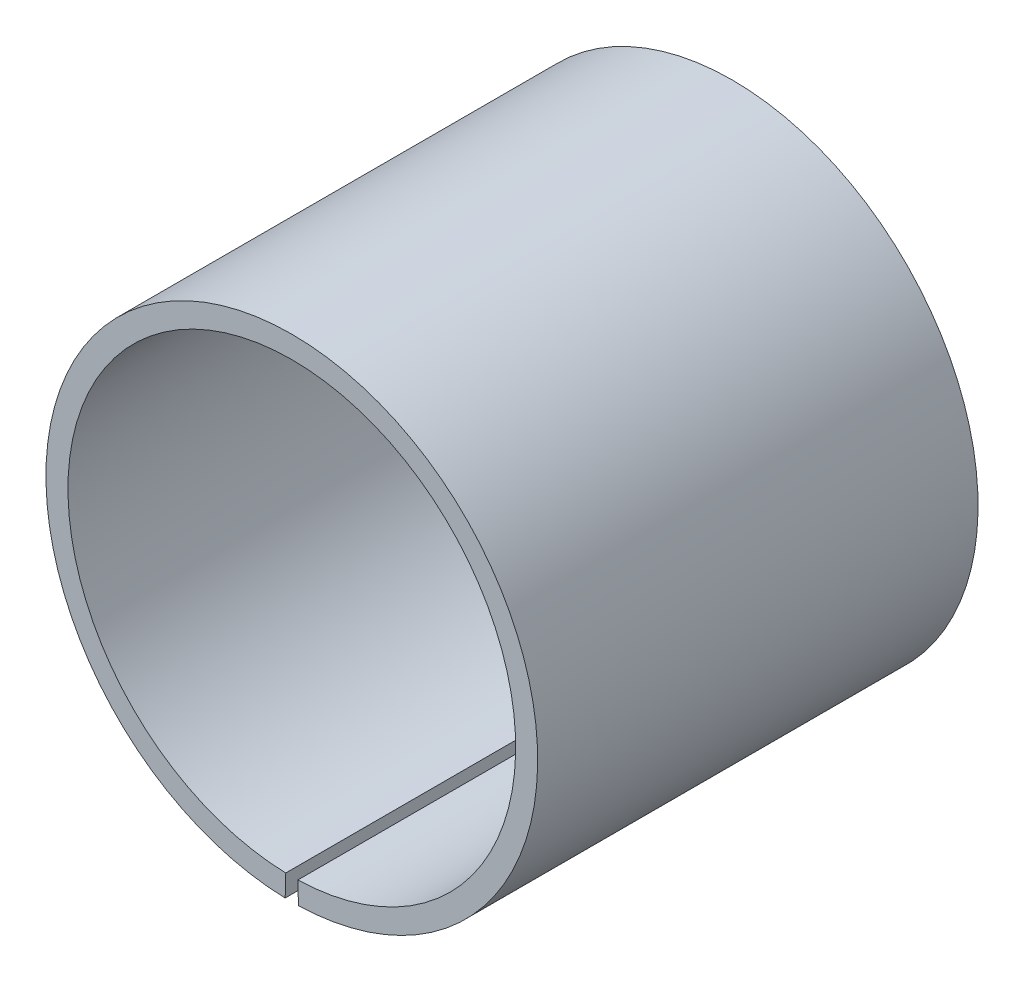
from build123d import *

# Parameters (mm, degrees)
BOSS_EXTRUDE1_DEPTH = 15


with BuildPart() as part:
    # Sketch1 → Boss-Extrude1 (new, symmetric)
    with BuildSketch(Plane.XY):
        with BuildLine():
            Line((-0.411831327, -15.244438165), (-0.452339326, -16.743891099))
            ThreePointArc((-0.452339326, -16.743891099), (0, 16.75), (0.452339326, -16.743891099))
            Line((0.452339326, -16.743891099), (0.411831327, -15.244438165))
            ThreePointArc((0.411831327, -15.244438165), (0, 15.25), (-0.411831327, -15.244438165))
        make_face()
    extrude(amount=BOSS_EXTRUDE1_DEPTH, both=True)


solid = part.part
